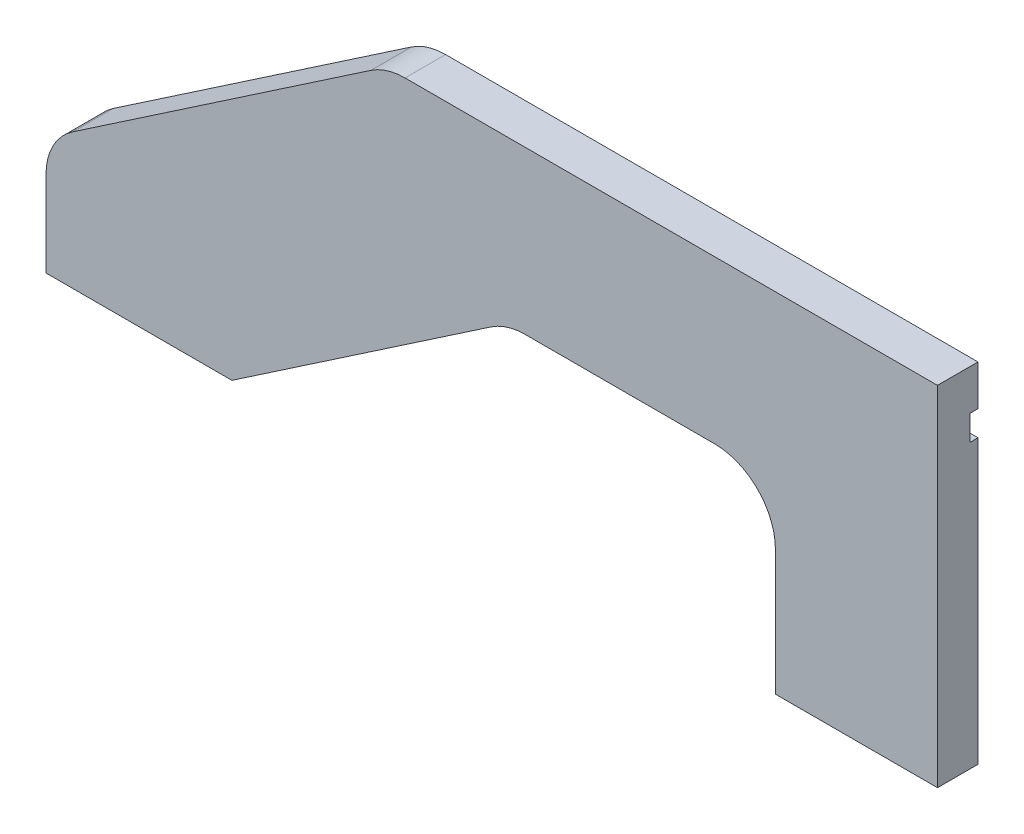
from build123d import *

# Parameters (mm, degrees)
EXTRUSION1_DEPTH        = 10
ESQUISSE2_W             = 126
ESQUISSE2_H             = 6.2
ESQUISSE2_W_2           = 30
ENL_V_MAT_EXTRU_1_DEPTH = 2
ENL_V_MAT_EXTRU_3_DEPTH = 153.756456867
CONG_1_R                = 15
ESQUISSE4_R             = 1.6
ENL_V_MAT_EXTRU_4_DEPTH = 2


with BuildPart() as part:
    # Esquisse1 → Extrusion1 (new body)
    with BuildSketch(Plane.XY):
        Polygon((145.537875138, -45.312934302), (-74.462124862, -45.312934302), (-74.462124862, -16.313588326), (9.537875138, 40.687065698), (145.537875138, 40.687065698), align=None)
    extrude(amount=EXTRUSION1_DEPTH)

    # Esquisse2 → Enl_v. mat.-Extru.1 (cut)
    with BuildSketch(Plane(origin=(0, 0, 0), x_dir=(-1, 0, 0), z_dir=(0, 0, -1))):
        with Locations((-82.537875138, 27.587065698)):
            Rectangle(ESQUISSE2_W, ESQUISSE2_H)
        with Locations((-6.537875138, 8.587065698)):
            Rectangle(ESQUISSE2_W_2, ESQUISSE2_H)
        with Locations((21.462124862, -10.412934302)):
            Rectangle(ESQUISSE2_W_2, ESQUISSE2_H)
        with Locations((49.462124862, -29.412934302)):
            Rectangle(ESQUISSE2_W_2, ESQUISSE2_H)
    extrude(amount=-ENL_V_MAT_EXTRU_1_DEPTH, mode=Mode.SUBTRACT)

    # Esquisse3 → Enl_v. mat.-Extru.3 (cut, through all)
    with BuildSketch(Plane(origin=(0, 0, 0), x_dir=(-1, 0, 0), z_dir=(0, 0, -1))):
        Polygon((-105.537875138, -45.312934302), (-105.537875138, 0.687065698), (-39.201004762, 0.687065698), (28.587691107, -45.312934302), align=None)
    extrude(amount=-ENL_V_MAT_EXTRU_3_DEPTH, mode=Mode.SUBTRACT)

    # Cong_1
    cong_1_edges = [part.edges().sort_by_distance(p)[0] for p in [
        (105.537875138, 0.687065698, 5),
        (39.201004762, 0.687065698, 5),
        (-74.462124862, -16.313588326, 5),
        (9.537875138, 40.687065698, 5),
    ]]
    fillet(cong_1_edges, radius=CONG_1_R)

    # Esquisse4 → Enl_v. mat.-Extru.4 (cut)
    with BuildSketch(Plane(origin=(0, 0, 0), x_dir=(-1, 0, 0), z_dir=(0, 0, -1))):
        with Locations((63.362124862, -27.412934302)):
            Circle(ESQUISSE4_R)
        with Locations((63.362124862, -31.412934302)):
            Circle(ESQUISSE4_R)
        with Locations((35.562124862, -31.412934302)):
            Circle(ESQUISSE4_R)
        with Locations((35.562124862, -27.412934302)):
            Circle(ESQUISSE4_R)
        with Locations((35.362124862, -8.412934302)):
            Circle(ESQUISSE4_R)
        with Locations((35.362124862, -12.412934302)):
            Circle(ESQUISSE4_R)
        with Locations((7.562124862, -12.412934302)):
            Circle(ESQUISSE4_R)
        with Locations((7.562124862, -8.412934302)):
            Circle(ESQUISSE4_R)
        with Locations((7.362124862, 10.587065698)):
            Circle(ESQUISSE4_R)
        with Locations((7.362124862, 6.587065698)):
            Circle(ESQUISSE4_R)
        with Locations((-20.437875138, 6.587065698)):
            Circle(ESQUISSE4_R)
        with Locations((-20.437875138, 10.587065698)):
            Circle(ESQUISSE4_R)
        with Locations((-20.637875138, 29.587065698)):
            Circle(ESQUISSE4_R)
        with Locations((-20.637875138, 25.587065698)):
            Circle(ESQUISSE4_R)
    extrude(amount=-ENL_V_MAT_EXTRU_4_DEPTH, mode=Mode.SUBTRACT)


solid = part.part
